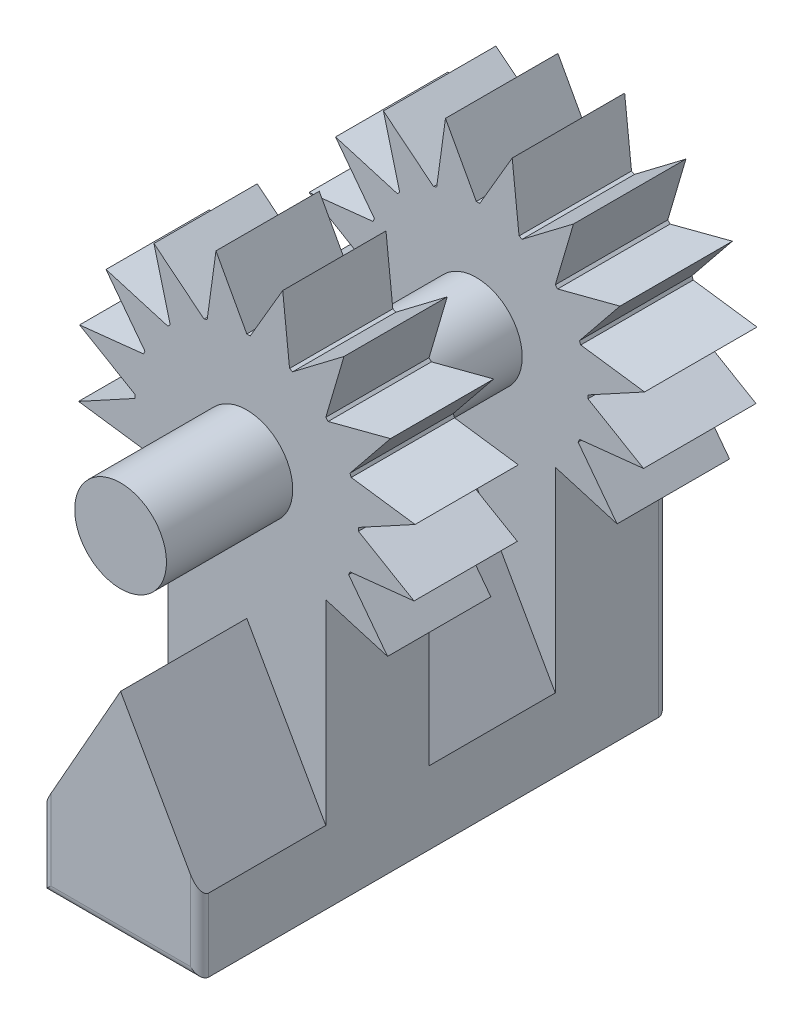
from build123d import *

# Parameters (mm, degrees)
SKETCH1_R           = 1.5
BOSS_EXTRUDE1_DEPTH = 15.3
BOSS_EXTRUDE2_START = -15.3
BOSS_EXTRUDE2_DEPTH = 15.3
CIRPATTERN1_COUNT   = 13
CIRPATTERN1_ANGLE   = 270
CUT_EXTRUDE1_START  = -4.125
SKETCH3_R           = 1.5
CUT_EXTRUDE1_DEPTH  = 4.125
LPATTERN1_COUNT     = 2
LPATTERN1_PITCH     = 7.5
SKETCH1_2_R         = 1.5
BOSS_EXTRUDE3_DEPTH = 15.3
FILLET2_R           = 0.3


with BuildPart() as part:
    # Sketch1 → Boss-Extrude1 (new body)
    with BuildSketch(Plane.XY):
        with BuildLine():
            Line((-2.580939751, 4.384530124), (-2.580939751, -4.384530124))
            Line((-2.580939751, -4.384530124), (2.580939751, -4.384530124))
            Line((2.580939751, -4.384530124), (2.580939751, 4.384530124))
            ThreePointArc((2.580939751, 4.384530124), (0, 10.615469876), (-2.580939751, 4.384530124))
        make_face()
        with Locations((0, 6.965469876)):
            Circle(SKETCH1_R, mode=Mode.SUBTRACT)
    extrude(amount=BOSS_EXTRUDE1_DEPTH)

    # Sketch2 → Boss-Extrude2 (add)
    with BuildSketch(Plane.XY.offset(15.3).offset(BOSS_EXTRUDE2_START)):
        with BuildLine():
            Line((4.600654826, 3.789867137), (3.328434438, 5.467463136))
            ThreePointArc((3.328434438, 5.467463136), (3.003891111, 4.89203355), (2.580939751, 4.384530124))
            Line((2.580939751, 4.384530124), (4.600654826, 3.789867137))
        make_face()
    boss_extrude2 = extrude(amount=BOSS_EXTRUDE2_DEPTH)

    # CirPattern1: Boss-Extrude2 ×13 about axis, 1 skipped
    cirpattern1_axis = Axis((0, 6.965469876, 0), (0, 0, 1))
    add([boss_extrude2.rotate(cirpattern1_axis, i * CIRPATTERN1_ANGLE / (CIRPATTERN1_COUNT - 1)) for i in range(1, CIRPATTERN1_COUNT) if i not in (12,)])

    # Sketch3 → Cut-Extrude1 (cut)
    # profile 1 of 2: a face of its own
    with BuildSketch(Plane.XY.offset(15.3).offset(CUT_EXTRUDE1_START)):
        with BuildLine():
            Line((-2.580939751, 4.384530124), (-2.580939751, -2.003873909))
            Line((-2.580939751, -2.003873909), (0, 2.565469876))
            Line((0, 2.565469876), (2.580939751, -2.003873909))
            Line((2.580939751, -2.003873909), (2.580939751, 4.384530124))
            Line((2.580939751, 4.384530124), (3.328434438, 5.467463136))
            ThreePointArc((3.328434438, 5.467463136), (3.350679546, 5.517904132), (3.372160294, 5.568675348))
            Line((3.372160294, 5.568675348), (5.465701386, 5.792189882))
            Line((5.465701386, 5.792189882), (3.648334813, 6.855228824))
            ThreePointArc((3.648334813, 6.855228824), (3.64958368, 6.910343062), (3.65, 6.965469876))
            Line((3.65, 6.965469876), (5.498644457, 7.97313387))
            Line((5.498644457, 7.97313387), (3.412809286, 8.259777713))
            ThreePointArc((3.412809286, 8.259777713), (3.392871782, 8.31117455), (3.372160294, 8.362264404))
            Line((3.372160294, 8.362264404), (4.694468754, 10.00067015))
            Line((4.694468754, 10.00067015), (2.657714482, 9.467279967))
            ThreePointArc((2.657714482, 9.467279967), (2.619625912, 9.5071347), (2.580939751, 9.546409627))
            Line((2.580939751, 9.546409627), (3.175602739, 11.566124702))
            Line((3.175602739, 11.566124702), (1.49800674, 10.293904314))
            ThreePointArc((1.49800674, 10.293904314), (1.447565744, 10.316149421), (1.396794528, 10.337630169))
            Line((1.396794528, 10.337630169), (1.173279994, 12.431171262))
            Line((1.173279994, 12.431171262), (0.110241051, 10.613804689))
            ThreePointArc((0.110241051, 10.613804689), (0.055126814, 10.615053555), (0, 10.615469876))
            Line((0, 10.615469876), (-1.007663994, 12.464114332))
            Line((-1.007663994, 12.464114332), (-1.294307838, 10.378279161))
            ThreePointArc((-1.294307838, 10.378279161), (-1.345704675, 10.358341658), (-1.396794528, 10.337630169))
            Line((-1.396794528, 10.337630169), (-3.035200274, 11.65993863))
            Line((-3.035200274, 11.65993863), (-2.501810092, 9.623184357))
            ThreePointArc((-2.501810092, 9.623184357), (-2.541664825, 9.585095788), (-2.580939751, 9.546409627))
            Line((-2.580939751, 9.546409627), (-4.600654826, 10.141072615))
            Line((-4.600654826, 10.141072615), (-3.328434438, 8.463476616))
            ThreePointArc((-3.328434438, 8.463476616), (-3.350679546, 8.41303562), (-3.372160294, 8.362264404))
            Line((-3.372160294, 8.362264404), (-5.465701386, 8.13874987))
            Line((-5.465701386, 8.13874987), (-3.648334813, 7.075710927))
            ThreePointArc((-3.648334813, 7.075710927), (-3.64958368, 7.020596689), (-3.65, 6.965469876))
            Line((-3.65, 6.965469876), (-5.498644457, 5.957805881))
            Line((-5.498644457, 5.957805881), (-3.412809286, 5.671162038))
            ThreePointArc((-3.412809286, 5.671162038), (-3.392871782, 5.619765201), (-3.372160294, 5.568675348))
            Line((-3.372160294, 5.568675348), (-4.694468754, 3.930269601))
            Line((-4.694468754, 3.930269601), (-2.657714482, 4.463659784))
            ThreePointArc((-2.657714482, 4.463659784), (-2.619625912, 4.423805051), (-2.580939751, 4.384530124))
        make_face()
        with Locations((0, 6.965469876)):
            Circle(SKETCH3_R, mode=Mode.SUBTRACT)
    # profile 2 of 2: a face of its own
    with BuildSketch(Plane.XY.offset(15.3).offset(CUT_EXTRUDE1_START)):
        Polygon((2.580939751, 4.384530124), (4.600654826, 3.789867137), (3.328434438, 5.467463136), align=None)
    cut_extrude1 = extrude(amount=CUT_EXTRUDE1_DEPTH, mode=Mode.SUBTRACT)

    # LPattern1: Cut-Extrude1 ×2
    with Locations(*[(0, 0, -i * LPATTERN1_PITCH) for i in range(1, LPATTERN1_COUNT)]):
        add(cut_extrude1, mode=Mode.SUBTRACT)

    # Sketch1_2 → Boss-Extrude3 (add)
    with BuildSketch(Plane.XY):
        with Locations((0, 6.965469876)):
            Circle(SKETCH1_2_R)
    extrude(amount=BOSS_EXTRUDE3_DEPTH)

    # Fillet2
    fillet2_edges = [part.edges().sort_by_distance(p)[0] for p in [
        (0, -4.384530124, 15.3),
        (2.580939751, -3.194202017, 15.3),
        (-2.580939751, -3.194202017, 15.3),
        (2.580939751, 0, 0),
        (0, -4.384530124, 0),
        (-2.580939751, 0, 0),
    ]]
    fillet(fillet2_edges, radius=FILLET2_R)


solid = part.part
